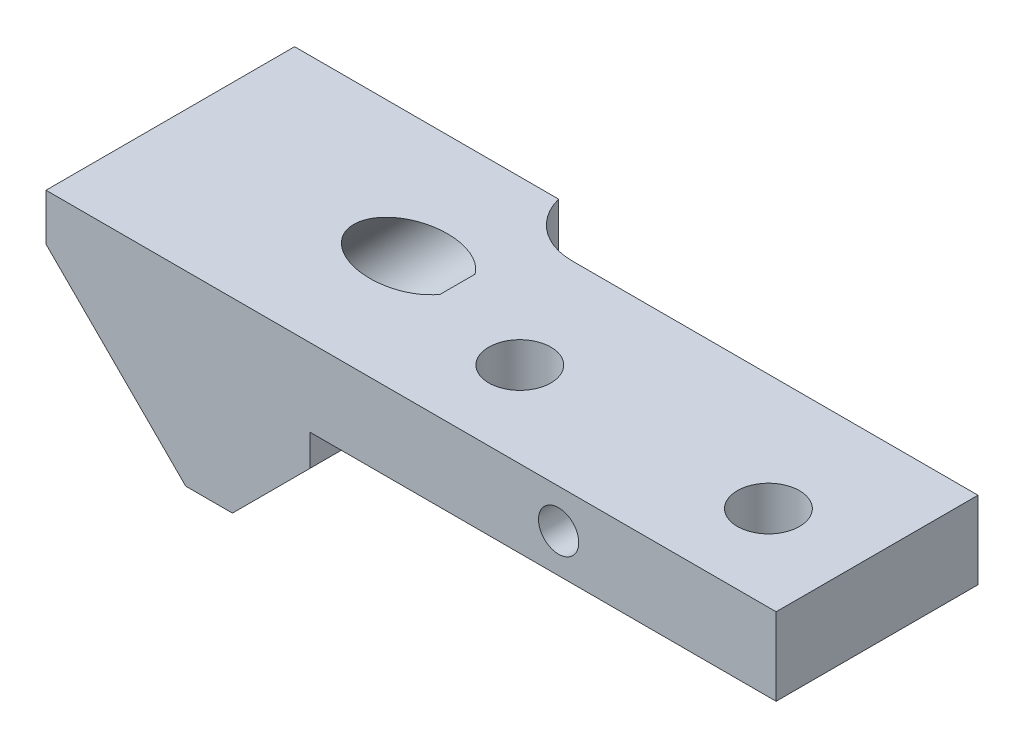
from build123d import *

# Parameters (mm, degrees)
BOSS_EXTRUDE1_DEPTH     = 12.7
SKETCH3_R               = 3.9624
CUT_EXTRUDE1_DEPTH      = 24.13
SKETCH4_R               = 3.175
CUT_EXTRUDE2_DEPTH      = 12.7
CUT_EXTRUDE3_DEPTH      = 82.150789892
CUT_EXTRUDE3_DEPTH_BACK = 82.150789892
CUT_EXTRUDE4_DEPTH      = 8.89
SKETCH8_R               = 2.0574
CUT_EXTRUDE5_DEPTH      = 17.78
CHAMFER1_SIZE           = 7.9248


with BuildPart() as part:
    # Sketch2 → Boss-Extrude1 (new, symmetric)
    with BuildSketch(Plane.XY):
        Polygon((-60.325, -11.1252), (-79.375, 7.9248), (0, 7.9248), (0, 0), (-47.625, 0), (-47.625, -11.1252), align=None)
    extrude(amount=BOSS_EXTRUDE1_DEPTH, both=True)

    # Sketch3 → Cut-Extrude1 (cut)
    with BuildSketch(Plane(origin=(-35.7251, -35.7251, 0), x_dir=(0, 0, 1), z_dir=(-0.7071067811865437, -0.7071067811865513, 0))):
        with Locations(Location((0, 41.139512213, 0), (0, 0, 270))):
            Circle(SKETCH3_R)
    extrude(amount=-CUT_EXTRUDE1_DEPTH, mode=Mode.SUBTRACT)

    # Sketch4 → Cut-Extrude2 (cut, symmetric)
    with BuildSketch(Plane(origin=(0, 0, 0), x_dir=(1, 0, 0), z_dir=(0, 1, 0))):
        with Locations(Location((-9.525, -3.9624, 0), (0, 0, 180))):
            Circle(SKETCH4_R)
        with Locations(Location((-34.925, -3.9624, 0), (0, 0, 180))):
            Circle(SKETCH4_R)
    extrude(amount=CUT_EXTRUDE2_DEPTH, both=True, mode=Mode.SUBTRACT)

    # Sketch5 → Cut-Extrude3 (cut, two sides: drawn at the far end of the back side and taken through both)
    with BuildSketch(Plane.XY.offset(-CUT_EXTRUDE3_DEPTH_BACK)):
        Polygon((-74.5998, 171.912236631), (-74.5998, 7.9248), (-74.5998, 3.1496), (-74.5998, -160.837836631), (-402.574673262, -160.837836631), (-402.574673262, 171.912236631), align=None)
    extrude(amount=CUT_EXTRUDE3_DEPTH + CUT_EXTRUDE3_DEPTH_BACK, mode=Mode.SUBTRACT)

    # Sketch6 → Cut-Extrude4 (cut)
    with BuildSketch(Plane(origin=(0, 0, 0), x_dir=(1, 0, 0), z_dir=(0, 1, 0))):
        with BuildLine():
            Line((0, 7.9248), (-41.473373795, 7.9248))
            ThreePointArc((-41.473373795, 7.9248), (-45.367120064, 9.258701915), (-47.625, 12.7))
            Line((-47.625, 12.7), (0, 12.7))
            Line((0, 12.7), (0, 7.9248))
        make_face()
    extrude(amount=CUT_EXTRUDE4_DEPTH, mode=Mode.SUBTRACT)

    # Sketch8 → Cut-Extrude5 (cut)
    with BuildSketch(Plane.XY):
        with Locations(Location((-22.225, 3.9624, 0), (0, 0, 180))):
            Circle(SKETCH8_R)
    extrude(amount=CUT_EXTRUDE5_DEPTH, mode=Mode.SUBTRACT)

    # Chamfer1
    chamfer1_edges = [part.edges().sort_by_distance(p)[0] for p in [
        (-47.625, -11.1252, 0),
    ]]
    chamfer(chamfer1_edges, length=CHAMFER1_SIZE)


solid = part.part
